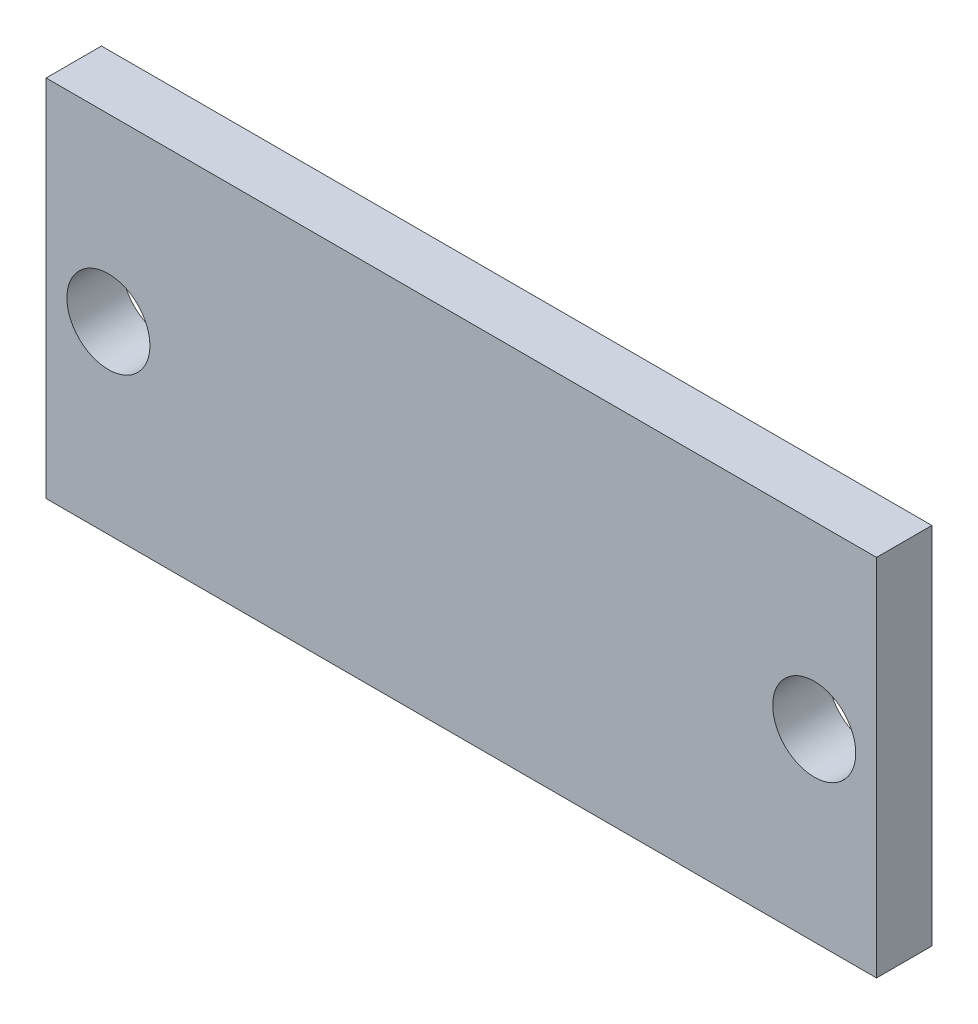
from build123d import *

# Parameters (mm, degrees)
CROQUIS1_W              = 30
CROQUIS1_H              = 13.16
CROQUIS1_R              = 1.5
SALIENTE_EXTRUIR1_DEPTH = 2


with BuildPart() as part:
    # Croquis1 → Saliente-Extruir1 (new body)
    with BuildSketch(Plane.XY):
        Rectangle(CROQUIS1_W, CROQUIS1_H)
        with Locations((-12.75, 0.08)):
            Circle(CROQUIS1_R, mode=Mode.SUBTRACT)
        with Locations((12.75, 0.08)):
            Circle(CROQUIS1_R, mode=Mode.SUBTRACT)
    extrude(amount=SALIENTE_EXTRUIR1_DEPTH)


solid = part.part
